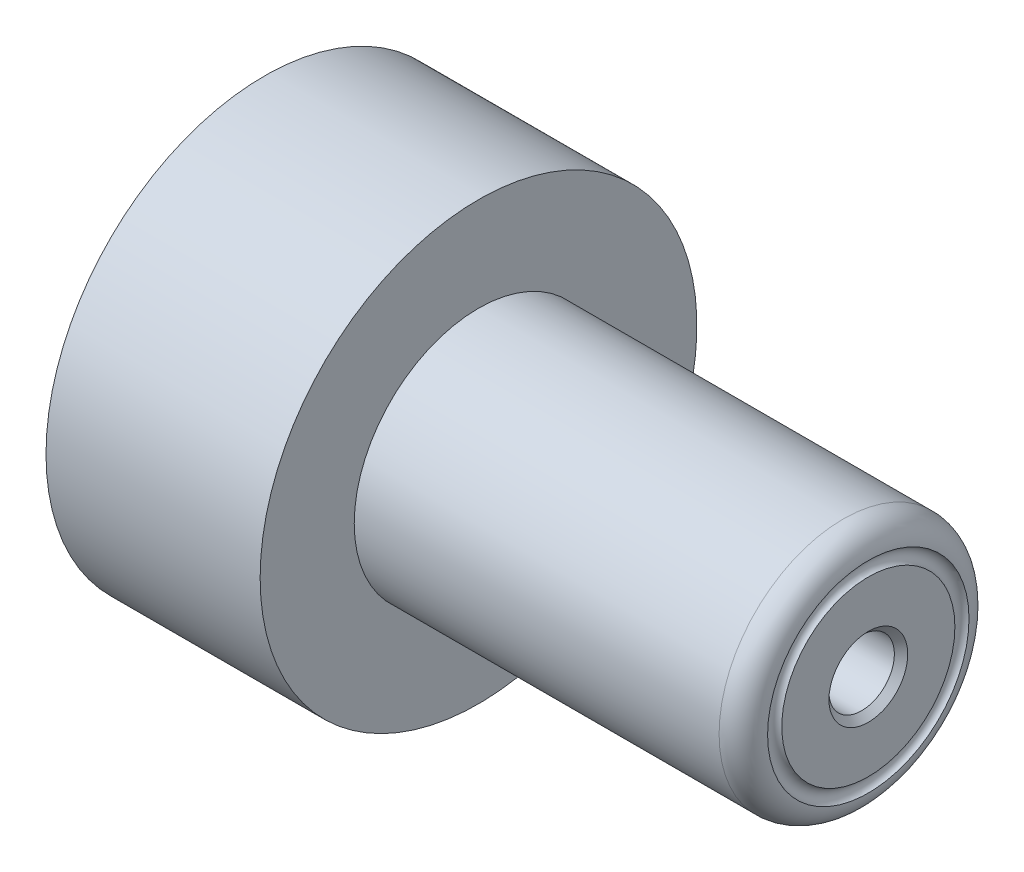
from build123d import *

# Parameters (mm, degrees)
SKETCH2_R          = 1.2065
CUT_EXTRUDE1_DEPTH = 2.54
SKETCH3_R          = 1.665
CUT_EXTRUDE2_DEPTH = 35.51889437
CHAMFER1_SIZE      = 0.34
SKETCH4_R          = 0.381


with BuildPart() as part:
    # Sketch1 → Revolve1 (revolve)
    with BuildSketch(Plane.XY, mode=Mode.PRIVATE) as revolve1_sk:
        with BuildLine():
            Line((0, 3.9751), (0, 11.1125))
            Line((0, 11.1125), (10.8966, 11.1125))
            Line((10.8966, 11.1125), (10.8966, 6.3246))
            Line((10.8966, 6.3246), (29.464, 6.3246))
            ThreePointArc((29.464, 6.3246), (30.362025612, 5.952625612), (30.734, 5.0546))
            Line((30.734, 5.0546), (30.734, 0))
            Line((30.734, 0), (21.8948, 0))
            Line((21.8948, 0), (21.8948, 3.9751))
            Line((21.8948, 3.9751), (0, 3.9751))
        make_face()
    revolve(revolve1_sk.sketch.rotate(Axis((0, 0, 0), (1, 0, 0)), 90), axis=Axis((0, 0, 0), (1, 0, 0)))

    # Sketch2 → Cut-Extrude1 (cut)
    with BuildSketch(Plane.ZY):
        with Locations((-6.7437, 0)):
            Circle(SKETCH2_R)
        with Locations(Location((6.7437, 0, 0), (0, 0, 180))):
            Circle(SKETCH2_R)
    extrude(amount=-CUT_EXTRUDE1_DEPTH, mode=Mode.SUBTRACT)

    # Sketch3 → Cut-Extrude2 (cut, through all)
    with BuildSketch(Plane(origin=(30.734, 0, 0), x_dir=(0, 0, -1), z_dir=(1, 0, 0))):
        Circle(SKETCH3_R)
    extrude(amount=-CUT_EXTRUDE2_DEPTH, mode=Mode.SUBTRACT)

    # Chamfer1
    chamfer1_edges = [part.edges().sort_by_distance(p)[0] for p in [
        (30.734, 0, 1.665),
    ]]
    chamfer(chamfer1_edges, length=CHAMFER1_SIZE)

    # Sketch4 → Cut-Revolve1 (revolve, cut)
    with BuildSketch(Plane.XY, mode=Mode.PRIVATE) as cut_revolve1_sk:
        with Locations((30.857, 4.765)):
            Circle(SKETCH4_R)
    revolve(cut_revolve1_sk.sketch.rotate(Axis((0, 0, 0), (1, 0, 0)), 90), axis=Axis((0, 0, 0), (1, 0, 0)), mode=Mode.SUBTRACT)


solid = part.part
